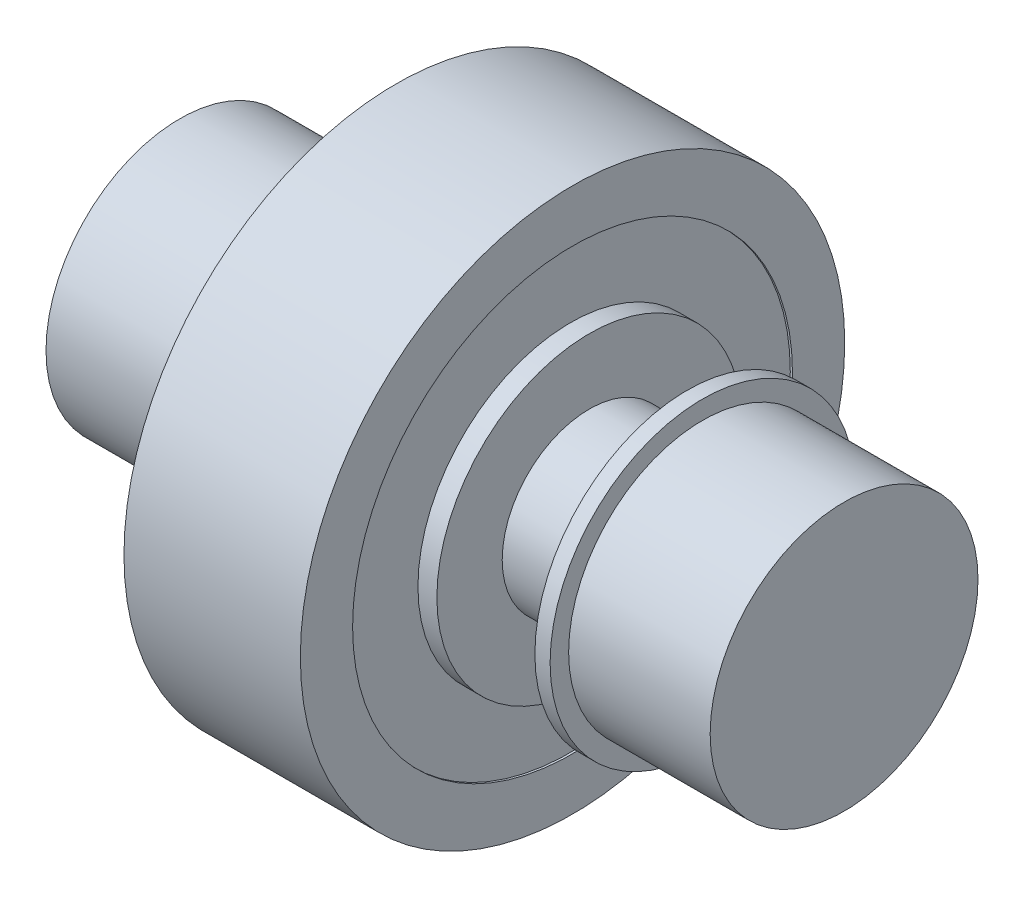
ISO-10303-21;
HEADER;
FILE_DESCRIPTION(('STEP AP214'),'2;1');
FILE_NAME('part.step','',(''),(''),'','','');
FILE_SCHEMA(('AUTOMOTIVE_DESIGN { 1 0 10303 214 1 1 1 1 }'));
ENDSEC;
DATA;
#1=APPLICATION_CONTEXT('core data for automotive mechanical design processes');
#2=APPLICATION_PROTOCOL_DEFINITION('international standard','automotive_design',2000,#1);
#3=PRODUCT_CONTEXT('',#1,'mechanical');
#4=PRODUCT('Part','Part','',(#3));
#5=PRODUCT_RELATED_PRODUCT_CATEGORY('part','',(#4));
#6=PRODUCT_DEFINITION_FORMATION('','',#4);
#7=PRODUCT_DEFINITION_CONTEXT('part definition',#1,'design');
#8=PRODUCT_DEFINITION('design','',#6,#7);
#9=PRODUCT_DEFINITION_SHAPE('','',#8);
#10=(LENGTH_UNIT() NAMED_UNIT(*) SI_UNIT(.MILLI.,.METRE.));
#11=(NAMED_UNIT(*) PLANE_ANGLE_UNIT() SI_UNIT($,.RADIAN.));
#12=(NAMED_UNIT(*) SI_UNIT($,.STERADIAN.) SOLID_ANGLE_UNIT());
#13=UNCERTAINTY_MEASURE_WITH_UNIT(LENGTH_MEASURE(1.E-05),#10,'distance_accuracy_value','');
#14=(GEOMETRIC_REPRESENTATION_CONTEXT(3) GLOBAL_UNCERTAINTY_ASSIGNED_CONTEXT((#13)) GLOBAL_UNIT_ASSIGNED_CONTEXT((#10,
#11,#12)) REPRESENTATION_CONTEXT('',''));
#15=CARTESIAN_POINT('',(0.,0.,0.));
#16=DIRECTION('',(0.,0.,1.));
#17=DIRECTION('',(1.,0.,0.));
#18=AXIS2_PLACEMENT_3D('',#15,#16,#17);
#19=CARTESIAN_POINT('',(26.8,101.,0.));
#20=DIRECTION('',(-1.,0.,0.));
#21=DIRECTION('',(0.,0.,1.));
#22=AXIS2_PLACEMENT_3D('',#19,#20,#21);
#23=PLANE('',#22);
#24=CARTESIAN_POINT('',(26.7999999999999,0.,0.));
#25=DIRECTION('',(-1.,0.,0.));
#26=DIRECTION('',(0.,0.,1.));
#27=AXIS2_PLACEMENT_3D('',#24,#25,#26);
#28=CIRCLE('',#27,101.);
#29=CARTESIAN_POINT('',(26.7999999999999,0.,101.));
#30=VERTEX_POINT('',#29);
#31=EDGE_CURVE('E10',#30,#30,#28,.T.);
#32=ORIENTED_EDGE('',*,*,#31,.F.);
#33=EDGE_LOOP('',(#32));
#34=FACE_BOUND('',#33,.T.);
#35=CARTESIAN_POINT('',(26.7999999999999,0.,0.));
#36=DIRECTION('',(-1.,0.,0.));
#37=DIRECTION('',(0.,0.,1.));
#38=AXIS2_PLACEMENT_3D('',#35,#36,#37);
#39=CIRCLE('',#38,70.);
#40=CARTESIAN_POINT('',(26.7999999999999,0.,70.));
#41=VERTEX_POINT('',#40);
#42=EDGE_CURVE('E69',#41,#41,#39,.T.);
#43=ORIENTED_EDGE('',*,*,#42,.T.);
#44=EDGE_LOOP('',(#43));
#45=FACE_BOUND('',#44,.T.);
#46=ADVANCED_FACE('F32',(#34,#45),#23,.F.);
#47=CARTESIAN_POINT('',(152.5,0.,0.));
#48=DIRECTION('',(-1.,0.,0.));
#49=DIRECTION('',(0.,0.,1.));
#50=AXIS2_PLACEMENT_3D('',#47,#48,#49);
#51=PLANE('',#50);
#52=CARTESIAN_POINT('',(152.5,0.,0.));
#53=DIRECTION('',(-1.,0.,0.));
#54=DIRECTION('',(0.,0.,1.));
#55=AXIS2_PLACEMENT_3D('',#52,#53,#54);
#56=CIRCLE('',#55,61.5);
#57=CARTESIAN_POINT('',(152.5,0.,61.5));
#58=VERTEX_POINT('',#57);
#59=EDGE_CURVE('E46',#58,#58,#56,.T.);
#60=ORIENTED_EDGE('',*,*,#59,.F.);
#61=EDGE_LOOP('',(#60));
#62=FACE_BOUND('',#61,.T.);
#63=ADVANCED_FACE('F108',(#62),#51,.F.);
#64=CARTESIAN_POINT('',(-1716.32432220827,0.,0.));
#65=DIRECTION('',(-1.,0.,0.));
#66=DIRECTION('',(0.,0.,1.));
#67=AXIS2_PLACEMENT_3D('',#64,#65,#66);
#68=CYLINDRICAL_SURFACE('',#67,61.5);
#69=CARTESIAN_POINT('',(87.4999999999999,0.,0.));
#70=DIRECTION('',(-1.,0.,0.));
#71=DIRECTION('',(0.,0.,1.));
#72=AXIS2_PLACEMENT_3D('',#69,#70,#71);
#73=CIRCLE('',#72,61.5);
#74=CARTESIAN_POINT('',(87.4999999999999,0.,61.5));
#75=VERTEX_POINT('',#74);
#76=EDGE_CURVE('E51',#75,#75,#73,.T.);
#77=ORIENTED_EDGE('',*,*,#76,.F.);
#78=EDGE_LOOP('',(#77));
#79=FACE_BOUND('',#78,.T.);
#80=ORIENTED_EDGE('',*,*,#59,.T.);
#81=EDGE_LOOP('',(#80));
#82=FACE_BOUND('',#81,.T.);
#83=ADVANCED_FACE('F113',(#79,#82),#68,.T.);
#84=CARTESIAN_POINT('',(87.5,70.,0.));
#85=DIRECTION('',(-1.,0.,0.));
#86=DIRECTION('',(0.,0.,1.));
#87=AXIS2_PLACEMENT_3D('',#84,#85,#86);
#88=PLANE('',#87);
#89=CARTESIAN_POINT('',(87.4999999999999,0.,0.));
#90=DIRECTION('',(-1.,0.,0.));
#91=DIRECTION('',(0.,0.,1.));
#92=AXIS2_PLACEMENT_3D('',#89,#90,#91);
#93=CIRCLE('',#92,70.);
#94=CARTESIAN_POINT('',(87.4999999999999,0.,70.));
#95=VERTEX_POINT('',#94);
#96=EDGE_CURVE('E54',#95,#95,#93,.T.);
#97=ORIENTED_EDGE('',*,*,#96,.F.);
#98=EDGE_LOOP('',(#97));
#99=FACE_BOUND('',#98,.T.);
#100=ORIENTED_EDGE('',*,*,#76,.T.);
#101=EDGE_LOOP('',(#100));
#102=FACE_BOUND('',#101,.T.);
#103=ADVANCED_FACE('F146',(#99,#102),#88,.F.);
#104=CARTESIAN_POINT('',(-1716.32432220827,0.,0.));
#105=DIRECTION('',(-1.,0.,0.));
#106=DIRECTION('',(0.,0.,1.));
#107=AXIS2_PLACEMENT_3D('',#104,#105,#106);
#108=CYLINDRICAL_SURFACE('',#107,70.);
#109=CARTESIAN_POINT('',(80.5,0.,0.));
#110=DIRECTION('',(-1.,0.,0.));
#111=DIRECTION('',(0.,0.,1.));
#112=AXIS2_PLACEMENT_3D('',#109,#110,#111);
#113=CIRCLE('',#112,70.);
#114=CARTESIAN_POINT('',(80.5,0.,70.));
#115=VERTEX_POINT('',#114);
#116=EDGE_CURVE('E57',#115,#115,#113,.T.);
#117=ORIENTED_EDGE('',*,*,#116,.F.);
#118=EDGE_LOOP('',(#117));
#119=FACE_BOUND('',#118,.T.);
#120=ORIENTED_EDGE('',*,*,#96,.T.);
#121=EDGE_LOOP('',(#120));
#122=FACE_BOUND('',#121,.T.);
#123=ADVANCED_FACE('F140',(#119,#122),#108,.T.);
#124=CARTESIAN_POINT('',(80.5,40.,0.));
#125=DIRECTION('',(1.,0.,0.));
#126=DIRECTION('',(0.,0.,-1.));
#127=AXIS2_PLACEMENT_3D('',#124,#125,#126);
#128=PLANE('',#127);
#129=CARTESIAN_POINT('',(80.5,0.,0.));
#130=DIRECTION('',(-1.,0.,0.));
#131=DIRECTION('',(0.,0.,1.));
#132=AXIS2_PLACEMENT_3D('',#129,#130,#131);
#133=CIRCLE('',#132,40.);
#134=CARTESIAN_POINT('',(80.5,0.,40.));
#135=VERTEX_POINT('',#134);
#136=EDGE_CURVE('E60',#135,#135,#133,.T.);
#137=ORIENTED_EDGE('',*,*,#136,.F.);
#138=EDGE_LOOP('',(#137));
#139=FACE_BOUND('',#138,.T.);
#140=ORIENTED_EDGE('',*,*,#116,.T.);
#141=EDGE_LOOP('',(#140));
#142=FACE_BOUND('',#141,.T.);
#143=ADVANCED_FACE('F134',(#139,#142),#128,.F.);
#144=CARTESIAN_POINT('',(-1716.32432220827,0.,0.));
#145=DIRECTION('',(-1.,0.,0.));
#146=DIRECTION('',(0.,0.,1.));
#147=AXIS2_PLACEMENT_3D('',#144,#145,#146);
#148=CYLINDRICAL_SURFACE('',#147,40.);
#149=CARTESIAN_POINT('',(35.5000000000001,0.,0.));
#150=DIRECTION('',(-1.,0.,0.));
#151=DIRECTION('',(0.,0.,1.));
#152=AXIS2_PLACEMENT_3D('',#149,#150,#151);
#153=CIRCLE('',#152,40.);
#154=CARTESIAN_POINT('',(35.5000000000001,0.,40.));
#155=VERTEX_POINT('',#154);
#156=EDGE_CURVE('E63',#155,#155,#153,.T.);
#157=ORIENTED_EDGE('',*,*,#156,.F.);
#158=EDGE_LOOP('',(#157));
#159=FACE_BOUND('',#158,.T.);
#160=ORIENTED_EDGE('',*,*,#136,.T.);
#161=EDGE_LOOP('',(#160));
#162=FACE_BOUND('',#161,.T.);
#163=ADVANCED_FACE('F128',(#159,#162),#148,.T.);
#164=CARTESIAN_POINT('',(35.5,70.,0.));
#165=DIRECTION('',(-1.,0.,0.));
#166=DIRECTION('',(0.,0.,1.));
#167=AXIS2_PLACEMENT_3D('',#164,#165,#166);
#168=PLANE('',#167);
#169=CARTESIAN_POINT('',(35.5000000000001,0.,0.));
#170=DIRECTION('',(-1.,0.,0.));
#171=DIRECTION('',(0.,0.,1.));
#172=AXIS2_PLACEMENT_3D('',#169,#170,#171);
#173=CIRCLE('',#172,70.);
#174=CARTESIAN_POINT('',(35.5000000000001,0.,70.));
#175=VERTEX_POINT('',#174);
#176=EDGE_CURVE('E66',#175,#175,#173,.T.);
#177=ORIENTED_EDGE('',*,*,#176,.F.);
#178=EDGE_LOOP('',(#177));
#179=FACE_BOUND('',#178,.T.);
#180=ORIENTED_EDGE('',*,*,#156,.T.);
#181=EDGE_LOOP('',(#180));
#182=FACE_BOUND('',#181,.T.);
#183=ADVANCED_FACE('F122',(#179,#182),#168,.F.);
#184=CARTESIAN_POINT('',(-1716.32432220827,0.,0.));
#185=DIRECTION('',(-1.,0.,0.));
#186=DIRECTION('',(0.,0.,1.));
#187=AXIS2_PLACEMENT_3D('',#184,#185,#186);
#188=CYLINDRICAL_SURFACE('',#187,70.);
#189=ORIENTED_EDGE('',*,*,#42,.F.);
#190=EDGE_LOOP('',(#189));
#191=FACE_BOUND('',#190,.T.);
#192=ORIENTED_EDGE('',*,*,#176,.T.);
#193=EDGE_LOOP('',(#192));
#194=FACE_BOUND('',#193,.T.);
#195=ADVANCED_FACE('F119',(#191,#194),#188,.T.);
#196=CARTESIAN_POINT('',(-53.2,101.,0.));
#197=DIRECTION('',(-1.,0.,0.));
#198=DIRECTION('',(0.,0.,1.));
#199=AXIS2_PLACEMENT_3D('',#196,#197,#198);
#200=PLANE('',#199);
#201=CARTESIAN_POINT('',(-53.2,0.,0.));
#202=DIRECTION('',(1.,0.,0.));
#203=DIRECTION('',(0.,0.,-1.));
#204=AXIS2_PLACEMENT_3D('',#201,#202,#203);
#205=CIRCLE('',#204,101.);
#206=CARTESIAN_POINT('',(-53.2,0.,-101.));
#207=VERTEX_POINT('',#206);
#208=EDGE_CURVE('E84',#207,#207,#205,.T.);
#209=ORIENTED_EDGE('',*,*,#208,.T.);
#210=EDGE_LOOP('',(#209));
#211=FACE_BOUND('',#210,.T.);
#212=CARTESIAN_POINT('',(-53.2,0.,0.));
#213=DIRECTION('',(1.,0.,0.));
#214=DIRECTION('',(0.,0.,-1.));
#215=AXIS2_PLACEMENT_3D('',#212,#213,#214);
#216=CIRCLE('',#215,125.);
#217=CARTESIAN_POINT('',(-53.2,0.,-125.));
#218=VERTEX_POINT('',#217);
#219=EDGE_CURVE('E72',#218,#218,#216,.T.);
#220=ORIENTED_EDGE('',*,*,#219,.F.);
#221=EDGE_LOOP('',(#220));
#222=FACE_BOUND('',#221,.T.);
#223=ADVANCED_FACE('F88',(#211,#222),#200,.T.);
#224=CARTESIAN_POINT('',(152.5,0.,0.));
#225=DIRECTION('',(1.,0.,0.));
#226=DIRECTION('',(0.,0.,-1.));
#227=AXIS2_PLACEMENT_3D('',#224,#225,#226);
#228=CYLINDRICAL_SURFACE('',#227,125.);
#229=ORIENTED_EDGE('',*,*,#219,.T.);
#230=EDGE_LOOP('',(#229));
#231=FACE_BOUND('',#230,.T.);
#232=CARTESIAN_POINT('',(27.8,0.,0.));
#233=DIRECTION('',(1.,0.,0.));
#234=DIRECTION('',(0.,0.,-1.));
#235=AXIS2_PLACEMENT_3D('',#232,#233,#234);
#236=CIRCLE('',#235,125.);
#237=CARTESIAN_POINT('',(27.8,0.,-125.));
#238=VERTEX_POINT('',#237);
#239=EDGE_CURVE('E75',#238,#238,#236,.T.);
#240=ORIENTED_EDGE('',*,*,#239,.F.);
#241=EDGE_LOOP('',(#240));
#242=FACE_BOUND('',#241,.T.);
#243=ADVANCED_FACE('F235',(#231,#242),#228,.T.);
#244=CARTESIAN_POINT('',(27.8,101.,0.));
#245=DIRECTION('',(1.,0.,0.));
#246=DIRECTION('',(0.,0.,-1.));
#247=AXIS2_PLACEMENT_3D('',#244,#245,#246);
#248=PLANE('',#247);
#249=ORIENTED_EDGE('',*,*,#239,.T.);
#250=EDGE_LOOP('',(#249));
#251=FACE_BOUND('',#250,.T.);
#252=CARTESIAN_POINT('',(27.8,0.,0.));
#253=DIRECTION('',(1.,0.,0.));
#254=DIRECTION('',(0.,0.,-1.));
#255=AXIS2_PLACEMENT_3D('',#252,#253,#254);
#256=CIRCLE('',#255,101.);
#257=CARTESIAN_POINT('',(27.8,0.,-101.));
#258=VERTEX_POINT('',#257);
#259=EDGE_CURVE('E78',#258,#258,#256,.T.);
#260=ORIENTED_EDGE('',*,*,#259,.F.);
#261=EDGE_LOOP('',(#260));
#262=FACE_BOUND('',#261,.T.);
#263=ADVANCED_FACE('F104',(#251,#262),#248,.T.);
#264=CARTESIAN_POINT('',(152.5,0.,0.));
#265=DIRECTION('',(1.,0.,0.));
#266=DIRECTION('',(0.,0.,-1.));
#267=AXIS2_PLACEMENT_3D('',#264,#265,#266);
#268=CYLINDRICAL_SURFACE('',#267,101.);
#269=ORIENTED_EDGE('',*,*,#259,.T.);
#270=EDGE_LOOP('',(#269));
#271=FACE_BOUND('',#270,.T.);
#272=ORIENTED_EDGE('',*,*,#31,.T.);
#273=EDGE_LOOP('',(#272));
#274=FACE_BOUND('',#273,.T.);
#275=ADVANCED_FACE('F94',(#271,#274),#268,.F.);
#276=CARTESIAN_POINT('',(152.5,0.,0.));
#277=DIRECTION('',(1.,0.,0.));
#278=DIRECTION('',(0.,0.,-1.));
#279=AXIS2_PLACEMENT_3D('',#276,#277,#278);
#280=CYLINDRICAL_SURFACE('',#279,101.);
#281=CARTESIAN_POINT('',(-44.5,0.,0.));
#282=DIRECTION('',(1.,0.,0.));
#283=DIRECTION('',(0.,0.,-1.));
#284=AXIS2_PLACEMENT_3D('',#281,#282,#283);
#285=CIRCLE('',#284,101.);
#286=CARTESIAN_POINT('',(-44.5,0.,-101.));
#287=VERTEX_POINT('',#286);
#288=EDGE_CURVE('E81',#287,#287,#285,.T.);
#289=ORIENTED_EDGE('',*,*,#288,.T.);
#290=EDGE_LOOP('',(#289));
#291=FACE_BOUND('',#290,.T.);
#292=ORIENTED_EDGE('',*,*,#208,.F.);
#293=EDGE_LOOP('',(#292));
#294=FACE_BOUND('',#293,.T.);
#295=ADVANCED_FACE('F91',(#291,#294),#280,.F.);
#296=CARTESIAN_POINT('',(-152.5,0.,0.));
#297=DIRECTION('',(1.,0.,0.));
#298=DIRECTION('',(0.,0.,-1.));
#299=AXIS2_PLACEMENT_3D('',#296,#297,#298);
#300=PLANE('',#299);
#301=CARTESIAN_POINT('',(-152.5,0.,0.));
#302=DIRECTION('',(-1.,0.,0.));
#303=DIRECTION('',(0.,0.,1.));
#304=AXIS2_PLACEMENT_3D('',#301,#302,#303);
#305=CIRCLE('',#304,61.5);
#306=CARTESIAN_POINT('',(-152.5,0.,61.5));
#307=VERTEX_POINT('',#306);
#308=EDGE_CURVE('E42',#307,#307,#305,.T.);
#309=ORIENTED_EDGE('',*,*,#308,.T.);
#310=EDGE_LOOP('',(#309));
#311=FACE_BOUND('',#310,.T.);
#312=ADVANCED_FACE('F93',(#311),#300,.F.);
#313=CARTESIAN_POINT('',(-1716.32432220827,0.,0.));
#314=DIRECTION('',(-1.,0.,0.));
#315=DIRECTION('',(0.,0.,1.));
#316=AXIS2_PLACEMENT_3D('',#313,#314,#315);
#317=CYLINDRICAL_SURFACE('',#316,61.5);
#318=ORIENTED_EDGE('',*,*,#308,.F.);
#319=EDGE_LOOP('',(#318));
#320=FACE_BOUND('',#319,.T.);
#321=CARTESIAN_POINT('',(-44.5,0.,0.));
#322=DIRECTION('',(-1.,0.,0.));
#323=DIRECTION('',(0.,0.,1.));
#324=AXIS2_PLACEMENT_3D('',#321,#322,#323);
#325=CIRCLE('',#324,61.5);
#326=CARTESIAN_POINT('',(-44.5,0.,61.5));
#327=VERTEX_POINT('',#326);
#328=EDGE_CURVE('E38',#327,#327,#325,.T.);
#329=ORIENTED_EDGE('',*,*,#328,.T.);
#330=EDGE_LOOP('',(#329));
#331=FACE_BOUND('',#330,.T.);
#332=ADVANCED_FACE('F101',(#320,#331),#317,.T.);
#333=CARTESIAN_POINT('',(-44.5,61.5,0.));
#334=DIRECTION('',(1.,0.,0.));
#335=DIRECTION('',(0.,0.,-1.));
#336=AXIS2_PLACEMENT_3D('',#333,#334,#335);
#337=PLANE('',#336);
#338=ORIENTED_EDGE('',*,*,#328,.F.);
#339=EDGE_LOOP('',(#338));
#340=FACE_BOUND('',#339,.T.);
#341=ORIENTED_EDGE('',*,*,#288,.F.);
#342=EDGE_LOOP('',(#341));
#343=FACE_BOUND('',#342,.T.);
#344=ADVANCED_FACE('F163',(#340,#343),#337,.F.);
#345=CLOSED_SHELL('',(#46,#63,#83,#103,#123,#143,#163,#183,#195,#223,#243,#263,#275,#295,#312,
#332,#344));
#346=MANIFOLD_SOLID_BREP('B2',#345);
#347=ADVANCED_BREP_SHAPE_REPRESENTATION('',(#18,#346),#14);
#348=SHAPE_DEFINITION_REPRESENTATION(#9,#347);
ENDSEC;
END-ISO-10303-21;
